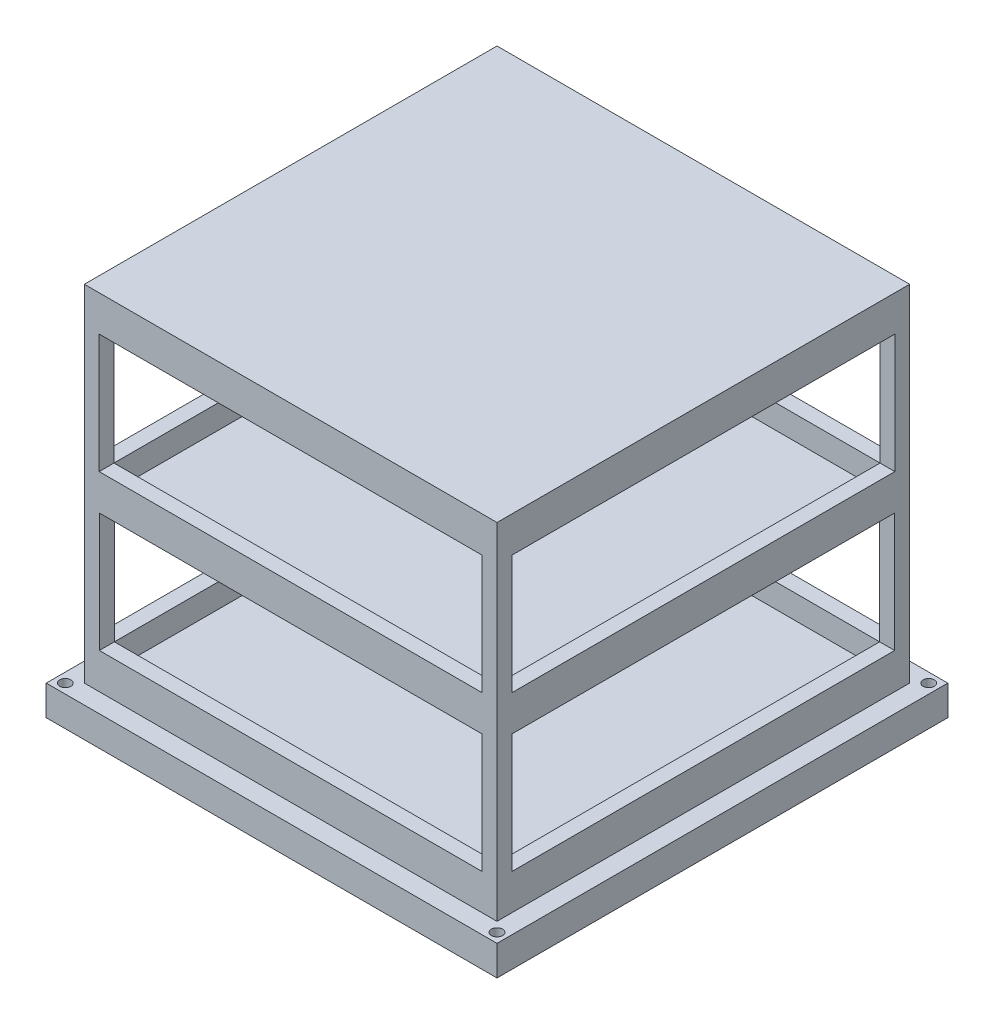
from build123d import *

# Parameters (mm, degrees)
SKETCH1_W           = 110
SKETCH1_H           = 110
BOSS_EXTRUDE1_DEPTH = 9.525
SKETCH3_W           = 120.16
SKETCH3_H           = 120.16
BOSS_EXTRUDE2_DEPTH = 8
SKETCH4_R           = 1.5
CUT_EXTRUDE2_DEPTH  = 86.498177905
SKETCH2_W           = 102
SKETCH2_H           = 102
CUT_EXTRUDE1_DEPTH  = 6.35
SKETCH5_W           = 4
SKETCH5_H           = 4
BOSS_EXTRUDE3_DEPTH = 31.75
SKETCH6_W           = 110
SKETCH6_H           = 110
BOSS_EXTRUDE4_DEPTH = 9.525
SKETCH7_W           = 102.108
SKETCH7_H           = 102.108
CUT_EXTRUDE3_DEPTH  = 6.35
SKETCH8_W           = 3.946
SKETCH8_H           = 3.946
BOSS_EXTRUDE5_DEPTH = 31.75
SKETCH9_W           = 110
SKETCH9_H           = 110
BOSS_EXTRUDE6_DEPTH = 9.525


with BuildPart() as part:
    # Sketch1 → Boss-Extrude1 (new body)
    with BuildSketch(Plane(origin=(0, 0, 0), x_dir=(1, 0, 0), z_dir=(0, 1, 0))):
        Rectangle(SKETCH1_W, SKETCH1_H)
    extrude(amount=BOSS_EXTRUDE1_DEPTH)

    # Sketch3 → Boss-Extrude2 (add)
    with BuildSketch(Plane.XZ):
        Rectangle(SKETCH3_W, SKETCH3_H)
    extrude(amount=BOSS_EXTRUDE2_DEPTH)

    # Sketch4 → Cut-Extrude2 (cut, through all)
    with BuildSketch(Plane(origin=(0, 0, 0), x_dir=(1, 0, 0), z_dir=(0, 1, 0))):
        with Locations(Location((-57.54, 57.54, 0), (0, 0, 270))):
            Circle(SKETCH4_R)
        with Locations(Location((57.54, 57.54, 0), (0, 0, 90))):
            Circle(SKETCH4_R)
        with Locations(Location((57.54, -57.54, 0), (0, 0, 270))):
            Circle(SKETCH4_R)
        with Locations(Location((-57.54, -57.54, 0), (0, 0, 90))):
            Circle(SKETCH4_R)
    extrude(amount=-CUT_EXTRUDE2_DEPTH, mode=Mode.SUBTRACT)

    # Sketch2 → Cut-Extrude1 (cut)
    with BuildSketch(Plane(origin=(0, 9.525, 0), x_dir=(1, 0, 0), z_dir=(0, 1, 0))):
        Rectangle(SKETCH2_W, SKETCH2_H)
    extrude(amount=-CUT_EXTRUDE1_DEPTH, mode=Mode.SUBTRACT)

    # Sketch5 → Boss-Extrude3 (add)
    with BuildSketch(Plane(origin=(0, 9.525, 0), x_dir=(1, 0, 0), z_dir=(0, 1, 0))):
        with Locations((-53, 53)):
            Rectangle(SKETCH5_W, SKETCH5_H)
        with Locations((-53, -53)):
            Rectangle(SKETCH5_W, SKETCH5_H)
        with Locations((53, -53)):
            Rectangle(SKETCH5_W, SKETCH5_H)
        with Locations((53, 53)):
            Rectangle(SKETCH5_W, SKETCH5_H)
    extrude(amount=BOSS_EXTRUDE3_DEPTH)

    # Sketch6 → Boss-Extrude4 (add)
    with BuildSketch(Plane(origin=(0, 41.275, 0), x_dir=(1, 0, 0), z_dir=(0, 1, 0))):
        Rectangle(SKETCH6_W, SKETCH6_H)
    extrude(amount=BOSS_EXTRUDE4_DEPTH)

    # Sketch7 → Cut-Extrude3 (cut)
    with BuildSketch(Plane(origin=(0, 50.8, 0), x_dir=(1, 0, 0), z_dir=(0, 1, 0))):
        Rectangle(SKETCH7_W, SKETCH7_H)
    extrude(amount=-CUT_EXTRUDE3_DEPTH, mode=Mode.SUBTRACT)

    # Sketch8 → Boss-Extrude5 (add)
    with BuildSketch(Plane(origin=(0, 50.8, 0), x_dir=(1, 0, 0), z_dir=(0, 1, 0))):
        with Locations((-53.027, 53.027)):
            Rectangle(SKETCH8_W, SKETCH8_H)
        with Locations((53.027, 53.027)):
            Rectangle(SKETCH8_W, SKETCH8_H)
        with Locations((53.027, -53.027)):
            Rectangle(SKETCH8_W, SKETCH8_H)
        with Locations((-53.027, -53.027)):
            Rectangle(SKETCH8_W, SKETCH8_H)
    extrude(amount=BOSS_EXTRUDE5_DEPTH)

    # Sketch9 → Boss-Extrude6 (add)
    with BuildSketch(Plane(origin=(0, 82.55, 0), x_dir=(1, 0, 0), z_dir=(0, 1, 0))):
        Rectangle(SKETCH9_W, SKETCH9_H)
    extrude(amount=BOSS_EXTRUDE6_DEPTH)


solid = part.part
